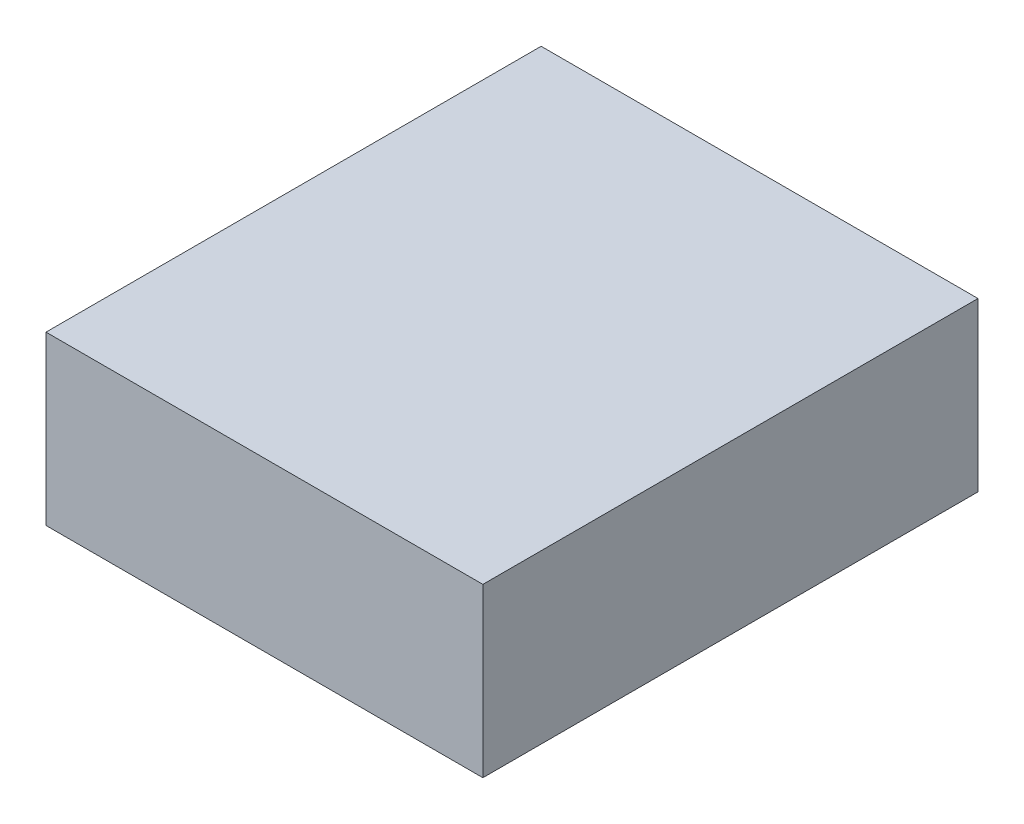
ISO-10303-21;
HEADER;
FILE_DESCRIPTION(('STEP AP214'),'2;1');
FILE_NAME('part.step','',(''),(''),'','','');
FILE_SCHEMA(('AUTOMOTIVE_DESIGN { 1 0 10303 214 1 1 1 1 }'));
ENDSEC;
DATA;
#1=APPLICATION_CONTEXT('core data for automotive mechanical design processes');
#2=APPLICATION_PROTOCOL_DEFINITION('international standard','automotive_design',2000,#1);
#3=PRODUCT_CONTEXT('',#1,'mechanical');
#4=PRODUCT('Part','Part','',(#3));
#5=PRODUCT_RELATED_PRODUCT_CATEGORY('part','',(#4));
#6=PRODUCT_DEFINITION_FORMATION('','',#4);
#7=PRODUCT_DEFINITION_CONTEXT('part definition',#1,'design');
#8=PRODUCT_DEFINITION('design','',#6,#7);
#9=PRODUCT_DEFINITION_SHAPE('','',#8);
#10=(LENGTH_UNIT() NAMED_UNIT(*) SI_UNIT(.MILLI.,.METRE.));
#11=(NAMED_UNIT(*) PLANE_ANGLE_UNIT() SI_UNIT($,.RADIAN.));
#12=(NAMED_UNIT(*) SI_UNIT($,.STERADIAN.) SOLID_ANGLE_UNIT());
#13=UNCERTAINTY_MEASURE_WITH_UNIT(LENGTH_MEASURE(1.E-05),#10,'distance_accuracy_value','');
#14=(GEOMETRIC_REPRESENTATION_CONTEXT(3) GLOBAL_UNCERTAINTY_ASSIGNED_CONTEXT((#13)) GLOBAL_UNIT_ASSIGNED_CONTEXT((#10,
#11,#12)) REPRESENTATION_CONTEXT('',''));
#15=CARTESIAN_POINT('',(0.,0.,0.));
#16=DIRECTION('',(0.,0.,1.));
#17=DIRECTION('',(1.,0.,0.));
#18=AXIS2_PLACEMENT_3D('',#15,#16,#17);
#19=CARTESIAN_POINT('',(15.,5.75,34.));
#20=DIRECTION('',(-1.,0.,0.));
#21=DIRECTION('',(0.,-1.,0.));
#22=AXIS2_PLACEMENT_3D('',#19,#20,#21);
#23=PLANE('',#22);
#24=DIRECTION('',(0.,1.,0.));
#25=VECTOR('',#24,1.);
#26=CARTESIAN_POINT('',(15.,5.75,0.));
#27=LINE('',#26,#25);
#28=CARTESIAN_POINT('',(15.,-5.75,0.));
#29=VERTEX_POINT('',#28);
#30=CARTESIAN_POINT('',(15.,5.75,0.));
#31=VERTEX_POINT('',#30);
#32=EDGE_CURVE('E100',#29,#31,#27,.T.);
#33=ORIENTED_EDGE('',*,*,#32,.T.);
#34=DIRECTION('',(0.,0.,-1.));
#35=VECTOR('',#34,1.);
#36=CARTESIAN_POINT('',(15.,5.75,34.));
#37=LINE('',#36,#35);
#38=CARTESIAN_POINT('',(15.,5.75,34.));
#39=VERTEX_POINT('',#38);
#40=EDGE_CURVE('E11',#39,#31,#37,.T.);
#41=ORIENTED_EDGE('',*,*,#40,.F.);
#42=DIRECTION('',(0.,1.,0.));
#43=VECTOR('',#42,1.);
#44=CARTESIAN_POINT('',(15.,5.75,34.));
#45=LINE('',#44,#43);
#46=CARTESIAN_POINT('',(15.,-5.75,34.));
#47=VERTEX_POINT('',#46);
#48=EDGE_CURVE('E88',#47,#39,#45,.T.);
#49=ORIENTED_EDGE('',*,*,#48,.F.);
#50=DIRECTION('',(0.,0.,-1.));
#51=VECTOR('',#50,1.);
#52=CARTESIAN_POINT('',(15.,-5.75,34.));
#53=LINE('',#52,#51);
#54=EDGE_CURVE('E96',#47,#29,#53,.T.);
#55=ORIENTED_EDGE('',*,*,#54,.T.);
#56=EDGE_LOOP('',(#33,#41,#49,#55));
#57=FACE_BOUND('',#56,.T.);
#58=ADVANCED_FACE('F37',(#57),#23,.F.);
#59=CARTESIAN_POINT('',(-15.,5.75,34.));
#60=DIRECTION('',(0.,-1.,0.));
#61=DIRECTION('',(0.,0.,-1.));
#62=AXIS2_PLACEMENT_3D('',#59,#60,#61);
#63=PLANE('',#62);
#64=DIRECTION('',(-1.,0.,0.));
#65=VECTOR('',#64,1.);
#66=CARTESIAN_POINT('',(-15.,5.75,0.));
#67=LINE('',#66,#65);
#68=CARTESIAN_POINT('',(-15.,5.75,0.));
#69=VERTEX_POINT('',#68);
#70=EDGE_CURVE('E92',#31,#69,#67,.T.);
#71=ORIENTED_EDGE('',*,*,#70,.T.);
#72=DIRECTION('',(0.,0.,-1.));
#73=VECTOR('',#72,1.);
#74=CARTESIAN_POINT('',(-15.,5.75,34.));
#75=LINE('',#74,#73);
#76=CARTESIAN_POINT('',(-15.,5.75,34.));
#77=VERTEX_POINT('',#76);
#78=EDGE_CURVE('E45',#77,#69,#75,.T.);
#79=ORIENTED_EDGE('',*,*,#78,.F.);
#80=DIRECTION('',(-1.,0.,0.));
#81=VECTOR('',#80,1.);
#82=CARTESIAN_POINT('',(-15.,5.75,34.));
#83=LINE('',#82,#81);
#84=EDGE_CURVE('E83',#39,#77,#83,.T.);
#85=ORIENTED_EDGE('',*,*,#84,.F.);
#86=ORIENTED_EDGE('',*,*,#40,.T.);
#87=EDGE_LOOP('',(#71,#79,#85,#86));
#88=FACE_BOUND('',#87,.T.);
#89=ADVANCED_FACE('F91',(#88),#63,.F.);
#90=CARTESIAN_POINT('',(-15.,5.75,34.));
#91=DIRECTION('',(1.,0.,0.));
#92=DIRECTION('',(0.,0.,-1.));
#93=AXIS2_PLACEMENT_3D('',#90,#91,#92);
#94=PLANE('',#93);
#95=DIRECTION('',(0.,-1.,0.));
#96=VECTOR('',#95,1.);
#97=CARTESIAN_POINT('',(-15.,5.75,0.));
#98=LINE('',#97,#96);
#99=CARTESIAN_POINT('',(-15.,-5.75,0.));
#100=VERTEX_POINT('',#99);
#101=EDGE_CURVE('E70',#69,#100,#98,.T.);
#102=ORIENTED_EDGE('',*,*,#101,.T.);
#103=DIRECTION('',(0.,0.,-1.));
#104=VECTOR('',#103,1.);
#105=CARTESIAN_POINT('',(-15.,-5.75,34.));
#106=LINE('',#105,#104);
#107=CARTESIAN_POINT('',(-15.,-5.75,34.));
#108=VERTEX_POINT('',#107);
#109=EDGE_CURVE('E93',#108,#100,#106,.T.);
#110=ORIENTED_EDGE('',*,*,#109,.F.);
#111=DIRECTION('',(0.,-1.,0.));
#112=VECTOR('',#111,1.);
#113=CARTESIAN_POINT('',(-15.,5.75,34.));
#114=LINE('',#113,#112);
#115=EDGE_CURVE('E86',#77,#108,#114,.T.);
#116=ORIENTED_EDGE('',*,*,#115,.F.);
#117=ORIENTED_EDGE('',*,*,#78,.T.);
#118=EDGE_LOOP('',(#102,#110,#116,#117));
#119=FACE_BOUND('',#118,.T.);
#120=ADVANCED_FACE('F94',(#119),#94,.F.);
#121=CARTESIAN_POINT('',(-15.,-5.75,34.));
#122=DIRECTION('',(0.,1.,0.));
#123=DIRECTION('',(0.,0.,1.));
#124=AXIS2_PLACEMENT_3D('',#121,#122,#123);
#125=PLANE('',#124);
#126=DIRECTION('',(1.,0.,0.));
#127=VECTOR('',#126,1.);
#128=CARTESIAN_POINT('',(-15.,-5.75,0.));
#129=LINE('',#128,#127);
#130=EDGE_CURVE('E76',#100,#29,#129,.T.);
#131=ORIENTED_EDGE('',*,*,#130,.T.);
#132=ORIENTED_EDGE('',*,*,#54,.F.);
#133=DIRECTION('',(1.,0.,0.));
#134=VECTOR('',#133,1.);
#135=CARTESIAN_POINT('',(-15.,-5.75,34.));
#136=LINE('',#135,#134);
#137=EDGE_CURVE('E53',#108,#47,#136,.T.);
#138=ORIENTED_EDGE('',*,*,#137,.F.);
#139=ORIENTED_EDGE('',*,*,#109,.T.);
#140=EDGE_LOOP('',(#131,#132,#138,#139));
#141=FACE_BOUND('',#140,.T.);
#142=ADVANCED_FACE('F107',(#141),#125,.F.);
#143=CARTESIAN_POINT('',(0.,0.,34.));
#144=DIRECTION('',(0.,0.,1.));
#145=DIRECTION('',(1.,0.,0.));
#146=AXIS2_PLACEMENT_3D('',#143,#144,#145);
#147=PLANE('',#146);
#148=ORIENTED_EDGE('',*,*,#48,.T.);
#149=ORIENTED_EDGE('',*,*,#84,.T.);
#150=ORIENTED_EDGE('',*,*,#115,.T.);
#151=ORIENTED_EDGE('',*,*,#137,.T.);
#152=EDGE_LOOP('',(#148,#149,#150,#151));
#153=FACE_BOUND('',#152,.T.);
#154=ADVANCED_FACE('F84',(#153),#147,.T.);
#155=CARTESIAN_POINT('',(0.,0.,0.));
#156=DIRECTION('',(0.,0.,1.));
#157=DIRECTION('',(1.,0.,0.));
#158=AXIS2_PLACEMENT_3D('',#155,#156,#157);
#159=PLANE('',#158);
#160=ORIENTED_EDGE('',*,*,#32,.F.);
#161=ORIENTED_EDGE('',*,*,#130,.F.);
#162=ORIENTED_EDGE('',*,*,#101,.F.);
#163=ORIENTED_EDGE('',*,*,#70,.F.);
#164=EDGE_LOOP('',(#160,#161,#162,#163));
#165=FACE_BOUND('',#164,.T.);
#166=ADVANCED_FACE('F110',(#165),#159,.F.);
#167=CLOSED_SHELL('',(#58,#89,#120,#142,#154,#166));
#168=MANIFOLD_SOLID_BREP('B2',#167);
#169=ADVANCED_BREP_SHAPE_REPRESENTATION('',(#18,#168),#14);
#170=SHAPE_DEFINITION_REPRESENTATION(#9,#169);
ENDSEC;
END-ISO-10303-21;
